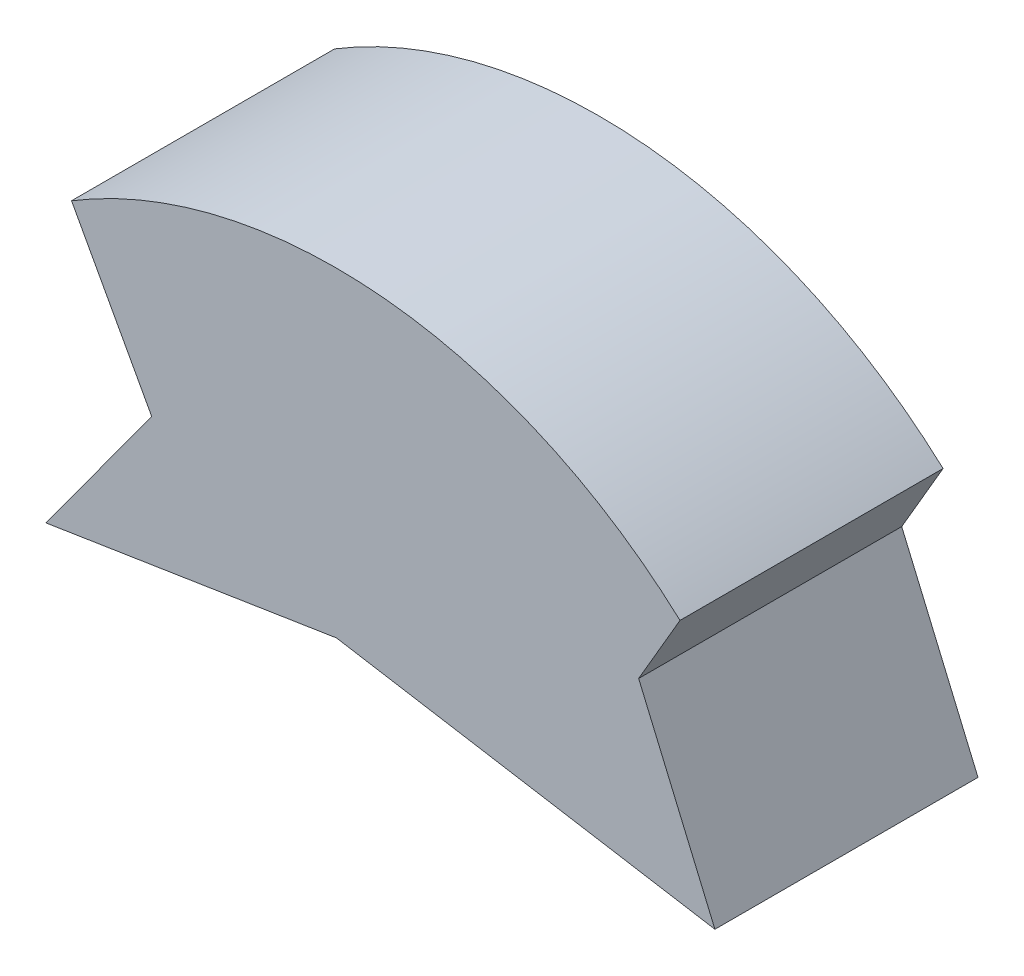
from build123d import *

# Parameters (mm, degrees)
BASE_EXTRUSION_DEPTH = 8


with BuildPart() as part:
    # Esquisse1 → Base-Extrusion (new, symmetric)
    with BuildSketch(Plane.XY):
        with BuildLine():
            Line((-274.303003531, -32.837001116), (-251.281554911, -36.673909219))
            Line((-251.281554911, -36.673909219), (-255.92070102, -25.783151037))
            Line((-255.92070102, -25.783151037), (-253.405577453, -21.465408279))
            ThreePointArc((-253.405577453, -21.465408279), (-271.309465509, -13.50207662), (-290.412227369, -17.866517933))
            Line((-290.412227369, -17.866517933), (-285.538020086, -26.788379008))
            Line((-285.538020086, -26.788379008), (-291.965491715, -35.612534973))
            Line((-291.965491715, -35.612534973), (-274.303003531, -32.837001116))
        make_face()
    extrude(amount=BASE_EXTRUSION_DEPTH, both=True)


solid = part.part
